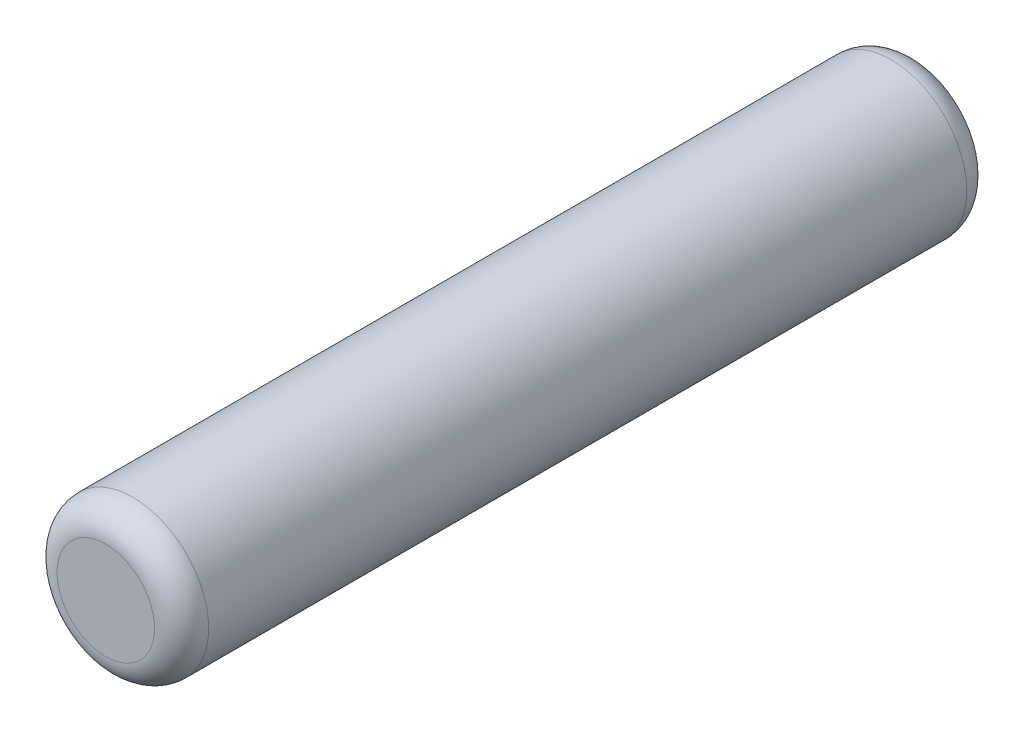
ISO-10303-21;
HEADER;
FILE_DESCRIPTION(('STEP AP214'),'2;1');
FILE_NAME('part.step','',(''),(''),'','','');
FILE_SCHEMA(('AUTOMOTIVE_DESIGN { 1 0 10303 214 1 1 1 1 }'));
ENDSEC;
DATA;
#1=APPLICATION_CONTEXT('core data for automotive mechanical design processes');
#2=APPLICATION_PROTOCOL_DEFINITION('international standard','automotive_design',2000,#1);
#3=PRODUCT_CONTEXT('',#1,'mechanical');
#4=PRODUCT('Part','Part','',(#3));
#5=PRODUCT_RELATED_PRODUCT_CATEGORY('part','',(#4));
#6=PRODUCT_DEFINITION_FORMATION('','',#4);
#7=PRODUCT_DEFINITION_CONTEXT('part definition',#1,'design');
#8=PRODUCT_DEFINITION('design','',#6,#7);
#9=PRODUCT_DEFINITION_SHAPE('','',#8);
#10=(LENGTH_UNIT() NAMED_UNIT(*) SI_UNIT(.MILLI.,.METRE.));
#11=(NAMED_UNIT(*) PLANE_ANGLE_UNIT() SI_UNIT($,.RADIAN.));
#12=(NAMED_UNIT(*) SI_UNIT($,.STERADIAN.) SOLID_ANGLE_UNIT());
#13=UNCERTAINTY_MEASURE_WITH_UNIT(LENGTH_MEASURE(1.E-05),#10,'distance_accuracy_value','');
#14=(GEOMETRIC_REPRESENTATION_CONTEXT(3) GLOBAL_UNCERTAINTY_ASSIGNED_CONTEXT((#13)) GLOBAL_UNIT_ASSIGNED_CONTEXT((#10,
#11,#12)) REPRESENTATION_CONTEXT('',''));
#15=CARTESIAN_POINT('',(0.,0.,0.));
#16=DIRECTION('',(0.,0.,1.));
#17=DIRECTION('',(1.,0.,0.));
#18=AXIS2_PLACEMENT_3D('',#15,#16,#17);
#19=CARTESIAN_POINT('',(0.,0.,15.));
#20=DIRECTION('',(0.,0.,-1.));
#21=DIRECTION('',(-1.,0.,0.));
#22=AXIS2_PLACEMENT_3D('',#19,#20,#21);
#23=CYLINDRICAL_SURFACE('',#22,1.4);
#24=CARTESIAN_POINT('',(0.,0.,0.5));
#25=DIRECTION('',(0.,0.,1.));
#26=DIRECTION('',(1.,0.,0.));
#27=AXIS2_PLACEMENT_3D('',#24,#25,#26);
#28=CIRCLE('',#27,1.4);
#29=CARTESIAN_POINT('',(1.4,0.,0.5));
#30=VERTEX_POINT('',#29);
#31=EDGE_CURVE('E41',#30,#30,#28,.T.);
#32=ORIENTED_EDGE('',*,*,#31,.T.);
#33=EDGE_LOOP('',(#32));
#34=FACE_BOUND('',#33,.T.);
#35=CARTESIAN_POINT('',(0.,0.,14.5));
#36=DIRECTION('',(0.,0.,1.));
#37=DIRECTION('',(1.,0.,0.));
#38=AXIS2_PLACEMENT_3D('',#35,#36,#37);
#39=CIRCLE('',#38,1.4);
#40=CARTESIAN_POINT('',(1.4,0.,14.5));
#41=VERTEX_POINT('',#40);
#42=EDGE_CURVE('E45',#41,#41,#39,.F.);
#43=ORIENTED_EDGE('',*,*,#42,.T.);
#44=EDGE_LOOP('',(#43));
#45=FACE_BOUND('',#44,.T.);
#46=ADVANCED_FACE('F30',(#34,#45),#23,.T.);
#47=CARTESIAN_POINT('',(0.,0.,15.));
#48=DIRECTION('',(0.,0.,1.));
#49=DIRECTION('',(1.,0.,0.));
#50=AXIS2_PLACEMENT_3D('',#47,#48,#49);
#51=PLANE('',#50);
#52=CARTESIAN_POINT('',(0.,0.,15.));
#53=DIRECTION('',(0.,0.,1.));
#54=DIRECTION('',(1.,0.,0.));
#55=AXIS2_PLACEMENT_3D('',#52,#53,#54);
#56=CIRCLE('',#55,0.9);
#57=CARTESIAN_POINT('',(0.9,0.,15.));
#58=VERTEX_POINT('',#57);
#59=EDGE_CURVE('E10',#58,#58,#56,.T.);
#60=ORIENTED_EDGE('',*,*,#59,.T.);
#61=EDGE_LOOP('',(#60));
#62=FACE_BOUND('',#61,.T.);
#63=ADVANCED_FACE('F61',(#62),#51,.T.);
#64=CARTESIAN_POINT('',(0.,0.,0.));
#65=DIRECTION('',(0.,0.,1.));
#66=DIRECTION('',(1.,0.,0.));
#67=AXIS2_PLACEMENT_3D('',#64,#65,#66);
#68=PLANE('',#67);
#69=CARTESIAN_POINT('',(0.,0.,0.));
#70=DIRECTION('',(0.,0.,1.));
#71=DIRECTION('',(1.,0.,0.));
#72=AXIS2_PLACEMENT_3D('',#69,#70,#71);
#73=CIRCLE('',#72,0.9);
#74=CARTESIAN_POINT('',(0.9,0.,0.));
#75=VERTEX_POINT('',#74);
#76=EDGE_CURVE('E37',#75,#75,#73,.F.);
#77=ORIENTED_EDGE('',*,*,#76,.T.);
#78=EDGE_LOOP('',(#77));
#79=FACE_BOUND('',#78,.T.);
#80=ADVANCED_FACE('F58',(#79),#68,.F.);
#81=CARTESIAN_POINT('',(0.,0.,0.5));
#82=DIRECTION('',(0.,0.,1.));
#83=DIRECTION('',(1.,0.,0.));
#84=AXIS2_PLACEMENT_3D('',#81,#82,#83);
#85=TOROIDAL_SURFACE('',#84,0.9,0.5);
#86=ORIENTED_EDGE('',*,*,#76,.F.);
#87=EDGE_LOOP('',(#86));
#88=FACE_BOUND('',#87,.T.);
#89=ORIENTED_EDGE('',*,*,#31,.F.);
#90=EDGE_LOOP('',(#89));
#91=FACE_BOUND('',#90,.T.);
#92=ADVANCED_FACE('F54',(#88,#91),#85,.T.);
#93=CARTESIAN_POINT('',(0.,0.,14.5));
#94=DIRECTION('',(0.,0.,1.));
#95=DIRECTION('',(1.,0.,0.));
#96=AXIS2_PLACEMENT_3D('',#93,#94,#95);
#97=TOROIDAL_SURFACE('',#96,0.9,0.5);
#98=ORIENTED_EDGE('',*,*,#42,.F.);
#99=EDGE_LOOP('',(#98));
#100=FACE_BOUND('',#99,.T.);
#101=ORIENTED_EDGE('',*,*,#59,.F.);
#102=EDGE_LOOP('',(#101));
#103=FACE_BOUND('',#102,.T.);
#104=ADVANCED_FACE('F32',(#100,#103),#97,.T.);
#105=CLOSED_SHELL('',(#46,#63,#80,#92,#104));
#106=MANIFOLD_SOLID_BREP('B2',#105);
#107=ADVANCED_BREP_SHAPE_REPRESENTATION('',(#18,#106),#14);
#108=SHAPE_DEFINITION_REPRESENTATION(#9,#107);
ENDSEC;
END-ISO-10303-21;
